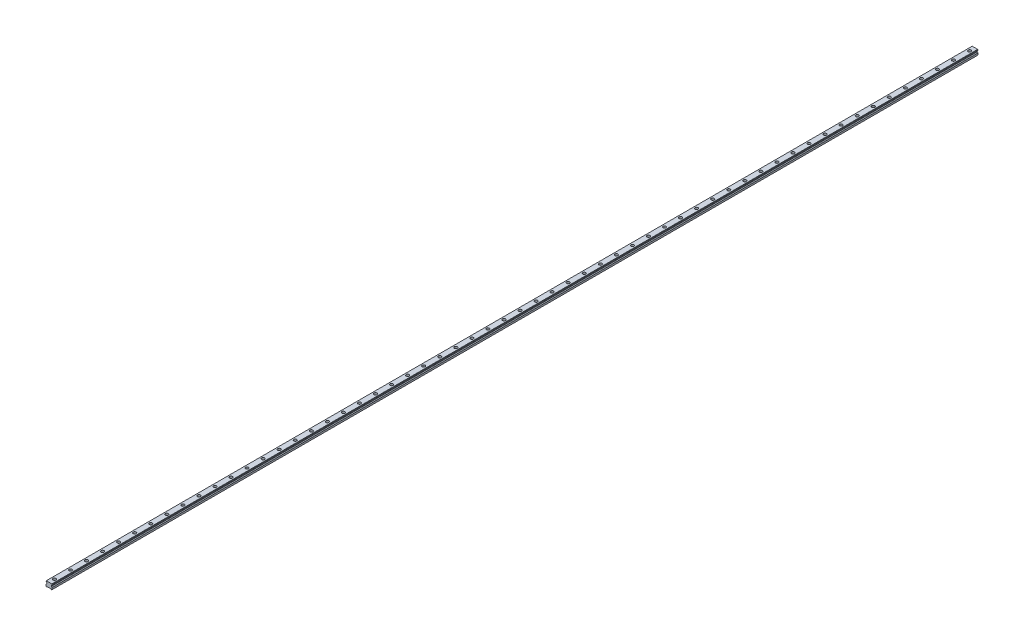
from build123d import *

# Parameters (mm, degrees)
SKETCH1_W           = 23
SKETCH1_H           = 19.2
BOSS_EXTRUDE1_DEPTH = 1730
CUT_EXTRUDE1_DEPTH  = 3461.072382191
CHAMFER1_SIZE       = 1.25
FILLET1_R           = 1.25
CUT_EXTRUDE2_DEPTH  = 3461.072382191
SKETCH4_R           = 5.5
SKETCH4_R_2         = 3.5
CUT_EXTRUDE3_DEPTH  = 9
SKETCH4_2_R         = 3.5
CUT_EXTRUDE4_DEPTH  = 1731.144759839
LPATTERN1_COUNT     = 58
LPATTERN1_PITCH     = 60


with BuildPart() as part:
    # Sketch1 → Boss-Extrude1 (new, symmetric)
    with BuildSketch(Plane.XY):
        with Locations((0, 9.6)):
            Rectangle(SKETCH1_W, SKETCH1_H)
    extrude(amount=BOSS_EXTRUDE1_DEPTH, both=True)

    # Sketch2 → Cut-Extrude1 (cut, through all)
    with BuildSketch(Plane.XY.offset(1730)):
        Polygon((-11.5, 16.7), (-11.5, 7.95), (-8.583333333, 10.866666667), (-8.583333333, 13.783333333), align=None)
        Polygon((8.583333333, 13.783333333), (11.5, 16.7), (11.5, 7.95), (8.583333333, 10.866666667), align=None)
    extrude(amount=-CUT_EXTRUDE1_DEPTH, mode=Mode.SUBTRACT)

    # Chamfer1
    chamfer1_edges = [part.edges().sort_by_distance(p)[0] for p in [
        (-11.5, 19.2, 0),
        (11.5, 19.2, 0),
        (11.5, 0, 0),
        (-11.5, 0, 0),
    ]]
    chamfer(chamfer1_edges, length=CHAMFER1_SIZE)

    # Fillet1
    fillet1_edges = [part.edges().sort_by_distance(p)[0] for p in [
        (-8.583333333, 13.783333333, 0),
        (-8.583333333, 10.866666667, 0),
        (8.583333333, 10.866666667, 0),
        (8.583333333, 13.783333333, 0),
    ]]
    fillet(fillet1_edges, radius=FILLET1_R)

    # Sketch3 → Cut-Extrude2 (cut, through all)
    with BuildSketch(Plane.XY.offset(1730)):
        Polygon((-7, 0), (-5.75, 1.25), (5.75, 1.25), (7, 0), align=None)
    extrude(amount=-CUT_EXTRUDE2_DEPTH, mode=Mode.SUBTRACT)

    # Sketch4 → Cut-Extrude3 (cut)
    with BuildSketch(Plane(origin=(0, 19.2, 0), x_dir=(1, 0, 0), z_dir=(0, 1, 0))):
        with Locations(Location((0, -1710, 0), (0, 0, 270))):
            Circle(SKETCH4_R)
        with Locations(Location((0, -1710, 0), (0, 0, 270))):
            Circle(SKETCH4_R_2, mode=Mode.SUBTRACT)
    cut_extrude3 = extrude(amount=-CUT_EXTRUDE3_DEPTH, mode=Mode.SUBTRACT)

    # Sketch4_2 → Cut-Extrude4 (cut, through all)
    with BuildSketch(Plane(origin=(0, 19.2, 0), x_dir=(1, 0, 0), z_dir=(0, 1, 0))):
        with Locations(Location((0, -1710, 0), (0, 0, 270))):
            Circle(SKETCH4_2_R)
    cut_extrude4 = extrude(amount=-CUT_EXTRUDE4_DEPTH, mode=Mode.SUBTRACT)

    # LPattern1: Cut-Extrude3, Cut-Extrude4 ×58
    with Locations(*[(0, 0, -i * LPATTERN1_PITCH) for i in range(1, LPATTERN1_COUNT)]):
        add(cut_extrude3, mode=Mode.SUBTRACT)
        add(cut_extrude4, mode=Mode.SUBTRACT)


solid = part.part
